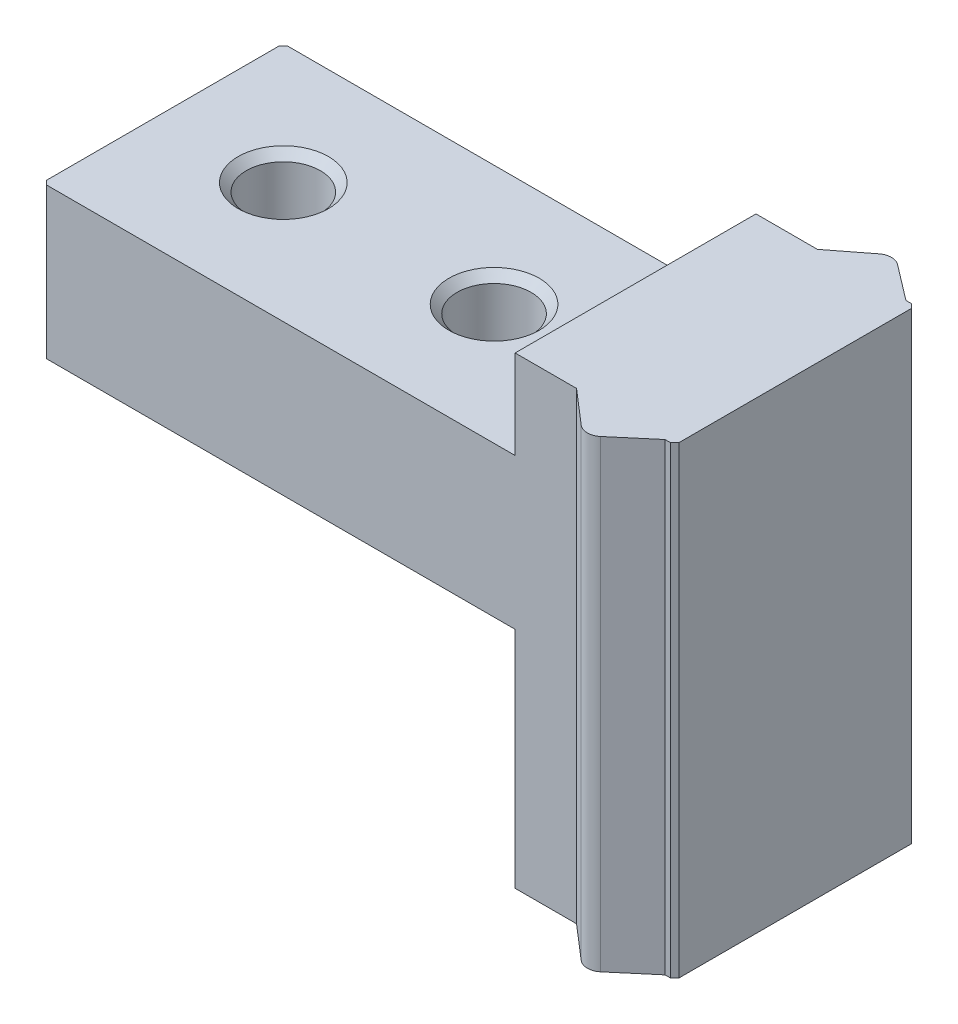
ISO-10303-21;
HEADER;
FILE_DESCRIPTION(('STEP AP214'),'2;1');
FILE_NAME('part.step','',(''),(''),'','','');
FILE_SCHEMA(('AUTOMOTIVE_DESIGN { 1 0 10303 214 1 1 1 1 }'));
ENDSEC;
DATA;
#1=APPLICATION_CONTEXT('core data for automotive mechanical design processes');
#2=APPLICATION_PROTOCOL_DEFINITION('international standard','automotive_design',2000,#1);
#3=PRODUCT_CONTEXT('',#1,'mechanical');
#4=PRODUCT('Part','Part','',(#3));
#5=PRODUCT_RELATED_PRODUCT_CATEGORY('part','',(#4));
#6=PRODUCT_DEFINITION_FORMATION('','',#4);
#7=PRODUCT_DEFINITION_CONTEXT('part definition',#1,'design');
#8=PRODUCT_DEFINITION('design','',#6,#7);
#9=PRODUCT_DEFINITION_SHAPE('','',#8);
#10=(LENGTH_UNIT() NAMED_UNIT(*) SI_UNIT(.MILLI.,.METRE.));
#11=(NAMED_UNIT(*) PLANE_ANGLE_UNIT() SI_UNIT($,.RADIAN.));
#12=(NAMED_UNIT(*) SI_UNIT($,.STERADIAN.) SOLID_ANGLE_UNIT());
#13=UNCERTAINTY_MEASURE_WITH_UNIT(LENGTH_MEASURE(1.E-05),#10,'distance_accuracy_value','');
#14=(GEOMETRIC_REPRESENTATION_CONTEXT(3) GLOBAL_UNCERTAINTY_ASSIGNED_CONTEXT((#13)) GLOBAL_UNIT_ASSIGNED_CONTEXT((#10,
#11,#12)) REPRESENTATION_CONTEXT('',''));
#15=CARTESIAN_POINT('',(0.,0.,0.));
#16=DIRECTION('',(0.,0.,1.));
#17=DIRECTION('',(1.,0.,0.));
#18=AXIS2_PLACEMENT_3D('',#15,#16,#17);
#19=CARTESIAN_POINT('',(-51.8,18.4,-4.));
#20=DIRECTION('',(1.,0.,0.));
#21=DIRECTION('',(0.,0.,-1.));
#22=AXIS2_PLACEMENT_3D('',#19,#20,#21);
#23=PLANE('',#22);
#24=DIRECTION('',(0.,0.,-1.));
#25=VECTOR('',#24,1.);
#26=CARTESIAN_POINT('',(-51.8,15.45,4.));
#27=LINE('',#26,#25);
#28=CARTESIAN_POINT('',(-51.8,15.45,4.));
#29=VERTEX_POINT('',#28);
#30=CARTESIAN_POINT('',(-51.8,15.45,-4.));
#31=VERTEX_POINT('',#30);
#32=EDGE_CURVE('E319',#29,#31,#27,.T.);
#33=ORIENTED_EDGE('',*,*,#32,.F.);
#34=DIRECTION('',(0.,-1.,0.));
#35=VECTOR('',#34,1.);
#36=CARTESIAN_POINT('',(-51.8,18.4,4.));
#37=LINE('',#36,#35);
#38=CARTESIAN_POINT('',(-51.8,18.4,4.));
#39=VERTEX_POINT('',#38);
#40=EDGE_CURVE('E284',#39,#29,#37,.T.);
#41=ORIENTED_EDGE('',*,*,#40,.F.);
#42=DIRECTION('',(0.,0.,1.));
#43=VECTOR('',#42,1.);
#44=CARTESIAN_POINT('',(-51.8,18.4,-4.));
#45=LINE('',#44,#43);
#46=CARTESIAN_POINT('',(-51.8,18.4,-4.));
#47=VERTEX_POINT('',#46);
#48=EDGE_CURVE('E191',#47,#39,#45,.T.);
#49=ORIENTED_EDGE('',*,*,#48,.F.);
#50=DIRECTION('',(0.,-1.,0.));
#51=VECTOR('',#50,1.);
#52=CARTESIAN_POINT('',(-51.8,18.4,-4.));
#53=LINE('',#52,#51);
#54=EDGE_CURVE('E11',#47,#31,#53,.T.);
#55=ORIENTED_EDGE('',*,*,#54,.T.);
#56=EDGE_LOOP('',(#33,#41,#49,#55));
#57=FACE_BOUND('',#56,.T.);
#58=ADVANCED_FACE('F16',(#57),#23,.F.);
#59=CARTESIAN_POINT('',(-49.76,18.4,-4.));
#60=DIRECTION('',(0.,0.,1.));
#61=DIRECTION('',(1.,0.,0.));
#62=AXIS2_PLACEMENT_3D('',#59,#60,#61);
#63=PLANE('',#62);
#64=DIRECTION('',(-1.,0.,0.));
#65=VECTOR('',#64,1.);
#66=CARTESIAN_POINT('',(-49.76,3.,-4.));
#67=LINE('',#66,#65);
#68=CARTESIAN_POINT('',(-49.76,3.,-4.));
#69=VERTEX_POINT('',#68);
#70=CARTESIAN_POINT('',(-51.8,3.,-4.));
#71=VERTEX_POINT('',#70);
#72=EDGE_CURVE('E179',#69,#71,#67,.T.);
#73=ORIENTED_EDGE('',*,*,#72,.T.);
#74=CARTESIAN_POINT('',(-51.8,10.45,-4.));
#75=VERTEX_POINT('',#74);
#76=EDGE_CURVE('E25',#75,#71,#53,.T.);
#77=ORIENTED_EDGE('',*,*,#76,.F.);
#78=DIRECTION('',(-1.,0.,0.));
#79=VECTOR('',#78,1.);
#80=CARTESIAN_POINT('',(-51.8,10.45,-4.));
#81=LINE('',#80,#79);
#82=CARTESIAN_POINT('',(-67.3585786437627,10.45,-4.));
#83=VERTEX_POINT('',#82);
#84=EDGE_CURVE('E341',#75,#83,#81,.T.);
#85=ORIENTED_EDGE('',*,*,#84,.T.);
#86=DIRECTION('',(0.,-1.,0.));
#87=VECTOR('',#86,1.);
#88=CARTESIAN_POINT('',(-67.3585786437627,15.45,-4.));
#89=LINE('',#88,#87);
#90=CARTESIAN_POINT('',(-67.3585786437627,15.45,-4.));
#91=VERTEX_POINT('',#90);
#92=EDGE_CURVE('E184',#91,#83,#89,.T.);
#93=ORIENTED_EDGE('',*,*,#92,.F.);
#94=DIRECTION('',(-1.,0.,0.));
#95=VECTOR('',#94,1.);
#96=CARTESIAN_POINT('',(-51.8,15.45,-4.));
#97=LINE('',#96,#95);
#98=EDGE_CURVE('E321',#31,#91,#97,.T.);
#99=ORIENTED_EDGE('',*,*,#98,.F.);
#100=ORIENTED_EDGE('',*,*,#54,.F.);
#101=DIRECTION('',(-1.,0.,0.));
#102=VECTOR('',#101,1.);
#103=CARTESIAN_POINT('',(-49.76,18.4,-4.));
#104=LINE('',#103,#102);
#105=CARTESIAN_POINT('',(-49.76,18.4,-4.));
#106=VERTEX_POINT('',#105);
#107=EDGE_CURVE('E188',#106,#47,#104,.T.);
#108=ORIENTED_EDGE('',*,*,#107,.F.);
#109=DIRECTION('',(0.,-1.,0.));
#110=VECTOR('',#109,1.);
#111=CARTESIAN_POINT('',(-49.76,18.4,-4.));
#112=LINE('',#111,#110);
#113=EDGE_CURVE('E217',#106,#69,#112,.T.);
#114=ORIENTED_EDGE('',*,*,#113,.T.);
#115=EDGE_LOOP('',(#73,#77,#85,#93,#99,#100,#108,#114));
#116=FACE_BOUND('',#115,.T.);
#117=ADVANCED_FACE('F18',(#116),#63,.F.);
#118=CARTESIAN_POINT('',(-51.8,10.45,4.));
#119=VERTEX_POINT('',#118);
#120=CARTESIAN_POINT('',(-51.8,3.,4.));
#121=VERTEX_POINT('',#120);
#122=EDGE_CURVE('E38',#119,#121,#37,.T.);
#123=ORIENTED_EDGE('',*,*,#122,.F.);
#124=DIRECTION('',(0.,0.,-1.));
#125=VECTOR('',#124,1.);
#126=CARTESIAN_POINT('',(-51.8,10.45,4.));
#127=LINE('',#126,#125);
#128=EDGE_CURVE('E33',#119,#75,#127,.T.);
#129=ORIENTED_EDGE('',*,*,#128,.T.);
#130=ORIENTED_EDGE('',*,*,#76,.T.);
#131=DIRECTION('',(0.,0.,1.));
#132=VECTOR('',#131,1.);
#133=CARTESIAN_POINT('',(-51.8,3.,-4.));
#134=LINE('',#133,#132);
#135=EDGE_CURVE('E182',#71,#121,#134,.T.);
#136=ORIENTED_EDGE('',*,*,#135,.T.);
#137=EDGE_LOOP('',(#123,#129,#130,#136));
#138=FACE_BOUND('',#137,.T.);
#139=ADVANCED_FACE('F296',(#138),#23,.F.);
#140=CARTESIAN_POINT('',(-51.8,18.4,4.));
#141=DIRECTION('',(0.,0.,-1.));
#142=DIRECTION('',(-1.,0.,0.));
#143=AXIS2_PLACEMENT_3D('',#140,#141,#142);
#144=PLANE('',#143);
#145=DIRECTION('',(1.,0.,0.));
#146=VECTOR('',#145,1.);
#147=CARTESIAN_POINT('',(-51.8,3.,4.));
#148=LINE('',#147,#146);
#149=CARTESIAN_POINT('',(-49.76,3.,4.));
#150=VERTEX_POINT('',#149);
#151=EDGE_CURVE('E220',#121,#150,#148,.T.);
#152=ORIENTED_EDGE('',*,*,#151,.T.);
#153=DIRECTION('',(0.,-1.,0.));
#154=VECTOR('',#153,1.);
#155=CARTESIAN_POINT('',(-49.76,18.4,4.));
#156=LINE('',#155,#154);
#157=CARTESIAN_POINT('',(-49.76,18.4,4.));
#158=VERTEX_POINT('',#157);
#159=EDGE_CURVE('E275',#158,#150,#156,.T.);
#160=ORIENTED_EDGE('',*,*,#159,.F.);
#161=DIRECTION('',(1.,0.,0.));
#162=VECTOR('',#161,1.);
#163=CARTESIAN_POINT('',(-51.8,18.4,4.));
#164=LINE('',#163,#162);
#165=EDGE_CURVE('E194',#39,#158,#164,.T.);
#166=ORIENTED_EDGE('',*,*,#165,.F.);
#167=ORIENTED_EDGE('',*,*,#40,.T.);
#168=DIRECTION('',(1.,0.,0.));
#169=VECTOR('',#168,1.);
#170=CARTESIAN_POINT('',(-67.3585786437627,15.45,4.));
#171=LINE('',#170,#169);
#172=CARTESIAN_POINT('',(-67.3585786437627,15.45,4.));
#173=VERTEX_POINT('',#172);
#174=EDGE_CURVE('E164',#173,#29,#171,.T.);
#175=ORIENTED_EDGE('',*,*,#174,.F.);
#176=DIRECTION('',(0.,-1.,0.));
#177=VECTOR('',#176,1.);
#178=CARTESIAN_POINT('',(-67.3585786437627,15.45,4.));
#179=LINE('',#178,#177);
#180=CARTESIAN_POINT('',(-67.3585786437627,10.45,4.));
#181=VERTEX_POINT('',#180);
#182=EDGE_CURVE('E160',#173,#181,#179,.T.);
#183=ORIENTED_EDGE('',*,*,#182,.T.);
#184=DIRECTION('',(1.,0.,0.));
#185=VECTOR('',#184,1.);
#186=CARTESIAN_POINT('',(-67.3585786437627,10.45,4.));
#187=LINE('',#186,#185);
#188=EDGE_CURVE('E294',#181,#119,#187,.T.);
#189=ORIENTED_EDGE('',*,*,#188,.T.);
#190=ORIENTED_EDGE('',*,*,#122,.T.);
#191=EDGE_LOOP('',(#152,#160,#166,#167,#175,#183,#189,#190));
#192=FACE_BOUND('',#191,.T.);
#193=ADVANCED_FACE('F290',(#192),#144,.F.);
#194=CARTESIAN_POINT('',(-49.76,18.4,4.));
#195=DIRECTION('',(0.653523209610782,0.,-0.756906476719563));
#196=DIRECTION('',(-0.756906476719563,0.,-0.653523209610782));
#197=AXIS2_PLACEMENT_3D('',#194,#195,#196);
#198=PLANE('',#197);
#199=DIRECTION('',(0.756906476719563,0.,0.653523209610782));
#200=VECTOR('',#199,1.);
#201=CARTESIAN_POINT('',(-49.76,3.,4.));
#202=LINE('',#201,#200);
#203=CARTESIAN_POINT('',(-48.6267616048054,3.,4.97845323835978));
#204=VERTEX_POINT('',#203);
#205=EDGE_CURVE('E222',#150,#204,#202,.T.);
#206=ORIENTED_EDGE('',*,*,#205,.T.);
#207=DIRECTION('',(0.,-1.,0.));
#208=VECTOR('',#207,1.);
#209=CARTESIAN_POINT('',(-48.6267616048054,18.4,4.97845323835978));
#210=LINE('',#209,#208);
#211=CARTESIAN_POINT('',(-48.6267616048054,18.4,4.97845323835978));
#212=VERTEX_POINT('',#211);
#213=EDGE_CURVE('E272',#212,#204,#210,.T.);
#214=ORIENTED_EDGE('',*,*,#213,.F.);
#215=DIRECTION('',(0.756906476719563,0.,0.653523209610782));
#216=VECTOR('',#215,1.);
#217=CARTESIAN_POINT('',(-49.76,18.4,4.));
#218=LINE('',#217,#216);
#219=EDGE_CURVE('E196',#158,#212,#218,.T.);
#220=ORIENTED_EDGE('',*,*,#219,.F.);
#221=ORIENTED_EDGE('',*,*,#159,.T.);
#222=EDGE_LOOP('',(#206,#214,#220,#221));
#223=FACE_BOUND('',#222,.T.);
#224=ADVANCED_FACE('F305',(#223),#198,.F.);
#225=CARTESIAN_POINT('',(-48.3,18.4,4.6));
#226=DIRECTION('',(0.,-1.,0.));
#227=DIRECTION('',(0.,0.,-1.));
#228=AXIS2_PLACEMENT_3D('',#225,#226,#227);
#229=CYLINDRICAL_SURFACE('',#228,0.500000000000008);
#230=CARTESIAN_POINT('',(-48.3,3.,4.6));
#231=DIRECTION('',(0.,1.,0.));
#232=DIRECTION('',(0.,0.,1.));
#233=AXIS2_PLACEMENT_3D('',#230,#231,#232);
#234=CIRCLE('',#233,0.500000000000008);
#235=CARTESIAN_POINT('',(-47.9765165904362,3.,4.98125907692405));
#236=VERTEX_POINT('',#235);
#237=EDGE_CURVE('E224',#204,#236,#234,.T.);
#238=ORIENTED_EDGE('',*,*,#237,.T.);
#239=DIRECTION('',(0.,-1.,0.));
#240=VECTOR('',#239,1.);
#241=CARTESIAN_POINT('',(-47.9765165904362,18.4,4.98125907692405));
#242=LINE('',#241,#240);
#243=CARTESIAN_POINT('',(-47.9765165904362,18.4,4.98125907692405));
#244=VERTEX_POINT('',#243);
#245=EDGE_CURVE('E269',#244,#236,#242,.T.);
#246=ORIENTED_EDGE('',*,*,#245,.F.);
#247=CARTESIAN_POINT('',(-48.3,18.4,4.6));
#248=DIRECTION('',(0.,1.,0.));
#249=DIRECTION('',(0.,0.,1.));
#250=AXIS2_PLACEMENT_3D('',#247,#248,#249);
#251=CIRCLE('',#250,0.500000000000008);
#252=EDGE_CURVE('E198',#212,#244,#251,.T.);
#253=ORIENTED_EDGE('',*,*,#252,.F.);
#254=ORIENTED_EDGE('',*,*,#213,.T.);
#255=EDGE_LOOP('',(#238,#246,#253,#254));
#256=FACE_BOUND('',#255,.T.);
#257=ADVANCED_FACE('F309',(#256),#229,.T.);
#258=CARTESIAN_POINT('',(-47.9765165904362,18.4,4.98125907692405));
#259=DIRECTION('',(-0.646966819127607,0.,-0.762518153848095));
#260=DIRECTION('',(-0.762518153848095,0.,0.646966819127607));
#261=AXIS2_PLACEMENT_3D('',#258,#259,#260);
#262=PLANE('',#261);
#263=DIRECTION('',(0.762518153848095,0.,-0.646966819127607));
#264=VECTOR('',#263,1.);
#265=CARTESIAN_POINT('',(-47.9765165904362,3.,4.98125907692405));
#266=LINE('',#265,#264);
#267=CARTESIAN_POINT('',(-46.82,3.,4.));
#268=VERTEX_POINT('',#267);
#269=EDGE_CURVE('E226',#236,#268,#266,.T.);
#270=ORIENTED_EDGE('',*,*,#269,.T.);
#271=DIRECTION('',(0.,-1.,0.));
#272=VECTOR('',#271,1.);
#273=CARTESIAN_POINT('',(-46.82,18.4,4.));
#274=LINE('',#273,#272);
#275=CARTESIAN_POINT('',(-46.82,18.4,4.));
#276=VERTEX_POINT('',#275);
#277=EDGE_CURVE('E266',#276,#268,#274,.T.);
#278=ORIENTED_EDGE('',*,*,#277,.F.);
#279=DIRECTION('',(0.762518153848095,0.,-0.646966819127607));
#280=VECTOR('',#279,1.);
#281=CARTESIAN_POINT('',(-47.9765165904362,18.4,4.98125907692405));
#282=LINE('',#281,#280);
#283=EDGE_CURVE('E200',#244,#276,#282,.T.);
#284=ORIENTED_EDGE('',*,*,#283,.F.);
#285=ORIENTED_EDGE('',*,*,#245,.T.);
#286=EDGE_LOOP('',(#270,#278,#284,#285));
#287=FACE_BOUND('',#286,.T.);
#288=ADVANCED_FACE('F407',(#287),#262,.F.);
#289=CARTESIAN_POINT('',(-46.82,18.4,4.));
#290=DIRECTION('',(0.,0.,-1.));
#291=DIRECTION('',(-1.,0.,0.));
#292=AXIS2_PLACEMENT_3D('',#289,#290,#291);
#293=PLANE('',#292);
#294=DIRECTION('',(1.,0.,0.));
#295=VECTOR('',#294,1.);
#296=CARTESIAN_POINT('',(-46.82,3.,4.));
#297=LINE('',#296,#295);
#298=CARTESIAN_POINT('',(-46.6414213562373,3.,4.));
#299=VERTEX_POINT('',#298);
#300=EDGE_CURVE('E228',#268,#299,#297,.T.);
#301=ORIENTED_EDGE('',*,*,#300,.T.);
#302=DIRECTION('',(0.,-1.,0.));
#303=VECTOR('',#302,1.);
#304=CARTESIAN_POINT('',(-46.6414213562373,18.4,4.));
#305=LINE('',#304,#303);
#306=CARTESIAN_POINT('',(-46.6414213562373,18.4,4.));
#307=VERTEX_POINT('',#306);
#308=EDGE_CURVE('E263',#307,#299,#305,.T.);
#309=ORIENTED_EDGE('',*,*,#308,.F.);
#310=DIRECTION('',(1.,0.,0.));
#311=VECTOR('',#310,1.);
#312=CARTESIAN_POINT('',(-46.82,18.4,4.));
#313=LINE('',#312,#311);
#314=EDGE_CURVE('E202',#276,#307,#313,.T.);
#315=ORIENTED_EDGE('',*,*,#314,.F.);
#316=ORIENTED_EDGE('',*,*,#277,.T.);
#317=EDGE_LOOP('',(#301,#309,#315,#316));
#318=FACE_BOUND('',#317,.T.);
#319=ADVANCED_FACE('F410',(#318),#293,.F.);
#320=CARTESIAN_POINT('',(-46.6414213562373,18.4,4.));
#321=DIRECTION('',(-0.707106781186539,0.,-0.707106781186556));
#322=DIRECTION('',(-0.707106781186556,0.,0.707106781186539));
#323=AXIS2_PLACEMENT_3D('',#320,#321,#322);
#324=PLANE('',#323);
#325=DIRECTION('',(0.707106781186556,0.,-0.707106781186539));
#326=VECTOR('',#325,1.);
#327=CARTESIAN_POINT('',(-46.6414213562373,3.,4.));
#328=LINE('',#327,#326);
#329=CARTESIAN_POINT('',(-46.5,3.,3.85857864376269));
#330=VERTEX_POINT('',#329);
#331=EDGE_CURVE('E230',#299,#330,#328,.T.);
#332=ORIENTED_EDGE('',*,*,#331,.T.);
#333=DIRECTION('',(0.,-1.,0.));
#334=VECTOR('',#333,1.);
#335=CARTESIAN_POINT('',(-46.5,18.4,3.85857864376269));
#336=LINE('',#335,#334);
#337=CARTESIAN_POINT('',(-46.5,18.4,3.85857864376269));
#338=VERTEX_POINT('',#337);
#339=EDGE_CURVE('E260',#338,#330,#336,.T.);
#340=ORIENTED_EDGE('',*,*,#339,.F.);
#341=DIRECTION('',(0.707106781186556,0.,-0.707106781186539));
#342=VECTOR('',#341,1.);
#343=CARTESIAN_POINT('',(-46.6414213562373,18.4,4.));
#344=LINE('',#343,#342);
#345=EDGE_CURVE('E204',#307,#338,#344,.T.);
#346=ORIENTED_EDGE('',*,*,#345,.F.);
#347=ORIENTED_EDGE('',*,*,#308,.T.);
#348=EDGE_LOOP('',(#332,#340,#346,#347));
#349=FACE_BOUND('',#348,.T.);
#350=ADVANCED_FACE('F414',(#349),#324,.F.);
#351=CARTESIAN_POINT('',(-46.5,18.4,3.85857864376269));
#352=DIRECTION('',(-1.,0.,0.));
#353=DIRECTION('',(0.,0.,1.));
#354=AXIS2_PLACEMENT_3D('',#351,#352,#353);
#355=PLANE('',#354);
#356=DIRECTION('',(0.,0.,-1.));
#357=VECTOR('',#356,1.);
#358=CARTESIAN_POINT('',(-46.5,3.,3.85857864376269));
#359=LINE('',#358,#357);
#360=CARTESIAN_POINT('',(-46.5,3.,-3.85857864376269));
#361=VERTEX_POINT('',#360);
#362=EDGE_CURVE('E232',#330,#361,#359,.T.);
#363=ORIENTED_EDGE('',*,*,#362,.T.);
#364=DIRECTION('',(0.,-1.,0.));
#365=VECTOR('',#364,1.);
#366=CARTESIAN_POINT('',(-46.5,18.4,-3.85857864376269));
#367=LINE('',#366,#365);
#368=CARTESIAN_POINT('',(-46.5,18.4,-3.85857864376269));
#369=VERTEX_POINT('',#368);
#370=EDGE_CURVE('E257',#369,#361,#367,.T.);
#371=ORIENTED_EDGE('',*,*,#370,.F.);
#372=DIRECTION('',(0.,0.,-1.));
#373=VECTOR('',#372,1.);
#374=CARTESIAN_POINT('',(-46.5,18.4,3.85857864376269));
#375=LINE('',#374,#373);
#376=EDGE_CURVE('E206',#338,#369,#375,.T.);
#377=ORIENTED_EDGE('',*,*,#376,.F.);
#378=ORIENTED_EDGE('',*,*,#339,.T.);
#379=EDGE_LOOP('',(#363,#371,#377,#378));
#380=FACE_BOUND('',#379,.T.);
#381=ADVANCED_FACE('F418',(#380),#355,.F.);
#382=CARTESIAN_POINT('',(-46.5,18.4,-3.85857864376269));
#383=DIRECTION('',(-0.707106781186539,0.,0.707106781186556));
#384=DIRECTION('',(0.707106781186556,0.,0.707106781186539));
#385=AXIS2_PLACEMENT_3D('',#382,#383,#384);
#386=PLANE('',#385);
#387=DIRECTION('',(-0.707106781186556,0.,-0.707106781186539));
#388=VECTOR('',#387,1.);
#389=CARTESIAN_POINT('',(-46.5,3.,-3.85857864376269));
#390=LINE('',#389,#388);
#391=CARTESIAN_POINT('',(-46.6414213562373,3.,-4.));
#392=VERTEX_POINT('',#391);
#393=EDGE_CURVE('E234',#361,#392,#390,.T.);
#394=ORIENTED_EDGE('',*,*,#393,.T.);
#395=DIRECTION('',(0.,-1.,0.));
#396=VECTOR('',#395,1.);
#397=CARTESIAN_POINT('',(-46.6414213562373,18.4,-4.));
#398=LINE('',#397,#396);
#399=CARTESIAN_POINT('',(-46.6414213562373,18.4,-4.));
#400=VERTEX_POINT('',#399);
#401=EDGE_CURVE('E254',#400,#392,#398,.T.);
#402=ORIENTED_EDGE('',*,*,#401,.F.);
#403=DIRECTION('',(-0.707106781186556,0.,-0.707106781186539));
#404=VECTOR('',#403,1.);
#405=CARTESIAN_POINT('',(-46.5,18.4,-3.85857864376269));
#406=LINE('',#405,#404);
#407=EDGE_CURVE('E208',#369,#400,#406,.T.);
#408=ORIENTED_EDGE('',*,*,#407,.F.);
#409=ORIENTED_EDGE('',*,*,#370,.T.);
#410=EDGE_LOOP('',(#394,#402,#408,#409));
#411=FACE_BOUND('',#410,.T.);
#412=ADVANCED_FACE('F422',(#411),#386,.F.);
#413=CARTESIAN_POINT('',(-46.6414213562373,18.4,-4.));
#414=DIRECTION('',(0.,0.,1.));
#415=DIRECTION('',(1.,0.,0.));
#416=AXIS2_PLACEMENT_3D('',#413,#414,#415);
#417=PLANE('',#416);
#418=DIRECTION('',(-1.,0.,0.));
#419=VECTOR('',#418,1.);
#420=CARTESIAN_POINT('',(-46.6414213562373,3.,-4.));
#421=LINE('',#420,#419);
#422=CARTESIAN_POINT('',(-46.82,3.,-4.));
#423=VERTEX_POINT('',#422);
#424=EDGE_CURVE('E236',#392,#423,#421,.T.);
#425=ORIENTED_EDGE('',*,*,#424,.T.);
#426=DIRECTION('',(0.,-1.,0.));
#427=VECTOR('',#426,1.);
#428=CARTESIAN_POINT('',(-46.82,18.4,-4.));
#429=LINE('',#428,#427);
#430=CARTESIAN_POINT('',(-46.82,18.4,-4.));
#431=VERTEX_POINT('',#430);
#432=EDGE_CURVE('E251',#431,#423,#429,.T.);
#433=ORIENTED_EDGE('',*,*,#432,.F.);
#434=DIRECTION('',(-1.,0.,0.));
#435=VECTOR('',#434,1.);
#436=CARTESIAN_POINT('',(-46.6414213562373,18.4,-4.));
#437=LINE('',#436,#435);
#438=EDGE_CURVE('E210',#400,#431,#437,.T.);
#439=ORIENTED_EDGE('',*,*,#438,.F.);
#440=ORIENTED_EDGE('',*,*,#401,.T.);
#441=EDGE_LOOP('',(#425,#433,#439,#440));
#442=FACE_BOUND('',#441,.T.);
#443=ADVANCED_FACE('F426',(#442),#417,.F.);
#444=CARTESIAN_POINT('',(-46.82,18.4,-4.));
#445=DIRECTION('',(-0.606457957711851,0.,0.795115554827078));
#446=DIRECTION('',(0.795115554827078,0.,0.606457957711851));
#447=AXIS2_PLACEMENT_3D('',#444,#445,#446);
#448=PLANE('',#447);
#449=DIRECTION('',(-0.795115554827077,0.,-0.606457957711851));
#450=VECTOR('',#449,1.);
#451=CARTESIAN_POINT('',(-46.82,3.,-4.));
#452=LINE('',#451,#450);
#453=CARTESIAN_POINT('',(-47.9967710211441,3.,-4.89755777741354));
#454=VERTEX_POINT('',#453);
#455=EDGE_CURVE('E238',#423,#454,#452,.T.);
#456=ORIENTED_EDGE('',*,*,#455,.T.);
#457=DIRECTION('',(0.,-1.,0.));
#458=VECTOR('',#457,1.);
#459=CARTESIAN_POINT('',(-47.9967710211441,18.4,-4.89755777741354));
#460=LINE('',#459,#458);
#461=CARTESIAN_POINT('',(-47.9967710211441,18.4,-4.89755777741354));
#462=VERTEX_POINT('',#461);
#463=EDGE_CURVE('E248',#462,#454,#460,.T.);
#464=ORIENTED_EDGE('',*,*,#463,.F.);
#465=DIRECTION('',(-0.795115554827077,0.,-0.606457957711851));
#466=VECTOR('',#465,1.);
#467=CARTESIAN_POINT('',(-46.82,18.4,-4.));
#468=LINE('',#467,#466);
#469=EDGE_CURVE('E212',#431,#462,#468,.T.);
#470=ORIENTED_EDGE('',*,*,#469,.F.);
#471=ORIENTED_EDGE('',*,*,#432,.T.);
#472=EDGE_LOOP('',(#456,#464,#470,#471));
#473=FACE_BOUND('',#472,.T.);
#474=ADVANCED_FACE('F430',(#473),#448,.F.);
#475=CARTESIAN_POINT('',(-48.3,18.4,-4.5));
#476=DIRECTION('',(0.,-1.,0.));
#477=DIRECTION('',(0.,0.,-1.));
#478=AXIS2_PLACEMENT_3D('',#475,#476,#477);
#479=CYLINDRICAL_SURFACE('',#478,0.5);
#480=CARTESIAN_POINT('',(-48.3,3.,-4.5));
#481=DIRECTION('',(0.,1.,0.));
#482=DIRECTION('',(0.,0.,1.));
#483=AXIS2_PLACEMENT_3D('',#480,#481,#482);
#484=CIRCLE('',#483,0.5);
#485=CARTESIAN_POINT('',(-48.6065166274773,3.,-4.89502855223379));
#486=VERTEX_POINT('',#485);
#487=EDGE_CURVE('E240',#454,#486,#484,.T.);
#488=ORIENTED_EDGE('',*,*,#487,.T.);
#489=DIRECTION('',(0.,-1.,0.));
#490=VECTOR('',#489,1.);
#491=CARTESIAN_POINT('',(-48.6065166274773,18.4,-4.89502855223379));
#492=LINE('',#491,#490);
#493=CARTESIAN_POINT('',(-48.6065166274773,18.4,-4.89502855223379));
#494=VERTEX_POINT('',#493);
#495=EDGE_CURVE('E245',#494,#486,#492,.T.);
#496=ORIENTED_EDGE('',*,*,#495,.F.);
#497=CARTESIAN_POINT('',(-48.3,18.4,-4.5));
#498=DIRECTION('',(0.,1.,0.));
#499=DIRECTION('',(0.,0.,1.));
#500=AXIS2_PLACEMENT_3D('',#497,#498,#499);
#501=CIRCLE('',#500,0.5);
#502=EDGE_CURVE('E214',#462,#494,#501,.T.);
#503=ORIENTED_EDGE('',*,*,#502,.F.);
#504=ORIENTED_EDGE('',*,*,#463,.T.);
#505=EDGE_LOOP('',(#488,#496,#503,#504));
#506=FACE_BOUND('',#505,.T.);
#507=ADVANCED_FACE('F434',(#506),#479,.T.);
#508=CARTESIAN_POINT('',(-48.6065166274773,18.4,-4.89502855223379));
#509=DIRECTION('',(0.613033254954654,0.,0.790057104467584));
#510=DIRECTION('',(0.790057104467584,0.,-0.613033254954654));
#511=AXIS2_PLACEMENT_3D('',#508,#509,#510);
#512=PLANE('',#511);
#513=DIRECTION('',(-0.790057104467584,0.,0.613033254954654));
#514=VECTOR('',#513,1.);
#515=CARTESIAN_POINT('',(-48.6065166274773,3.,-4.89502855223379));
#516=LINE('',#515,#514);
#517=EDGE_CURVE('E192',#486,#69,#516,.T.);
#518=ORIENTED_EDGE('',*,*,#517,.T.);
#519=ORIENTED_EDGE('',*,*,#113,.F.);
#520=DIRECTION('',(-0.790057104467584,0.,0.613033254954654));
#521=VECTOR('',#520,1.);
#522=CARTESIAN_POINT('',(-48.6065166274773,18.4,-4.89502855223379));
#523=LINE('',#522,#521);
#524=EDGE_CURVE('E216',#494,#106,#523,.T.);
#525=ORIENTED_EDGE('',*,*,#524,.F.);
#526=ORIENTED_EDGE('',*,*,#495,.T.);
#527=EDGE_LOOP('',(#518,#519,#525,#526));
#528=FACE_BOUND('',#527,.T.);
#529=ADVANCED_FACE('F438',(#528),#512,.F.);
#530=CARTESIAN_POINT('',(-48.3,18.4,4.6));
#531=DIRECTION('',(0.,1.,0.));
#532=DIRECTION('',(0.,0.,1.));
#533=AXIS2_PLACEMENT_3D('',#530,#531,#532);
#534=PLANE('',#533);
#535=ORIENTED_EDGE('',*,*,#107,.T.);
#536=ORIENTED_EDGE('',*,*,#48,.T.);
#537=ORIENTED_EDGE('',*,*,#165,.T.);
#538=ORIENTED_EDGE('',*,*,#219,.T.);
#539=ORIENTED_EDGE('',*,*,#252,.T.);
#540=ORIENTED_EDGE('',*,*,#283,.T.);
#541=ORIENTED_EDGE('',*,*,#314,.T.);
#542=ORIENTED_EDGE('',*,*,#345,.T.);
#543=ORIENTED_EDGE('',*,*,#376,.T.);
#544=ORIENTED_EDGE('',*,*,#407,.T.);
#545=ORIENTED_EDGE('',*,*,#438,.T.);
#546=ORIENTED_EDGE('',*,*,#469,.T.);
#547=ORIENTED_EDGE('',*,*,#502,.T.);
#548=ORIENTED_EDGE('',*,*,#524,.T.);
#549=EDGE_LOOP('',(#535,#536,#537,#538,#539,#540,#541,#542,#543,#544,#545,#546,#547,#548));
#550=FACE_BOUND('',#549,.T.);
#551=ADVANCED_FACE('F313',(#550),#534,.T.);
#552=CARTESIAN_POINT('',(-48.3,3.,4.6));
#553=DIRECTION('',(0.,1.,0.));
#554=DIRECTION('',(0.,0.,1.));
#555=AXIS2_PLACEMENT_3D('',#552,#553,#554);
#556=PLANE('',#555);
#557=ORIENTED_EDGE('',*,*,#72,.F.);
#558=ORIENTED_EDGE('',*,*,#517,.F.);
#559=ORIENTED_EDGE('',*,*,#487,.F.);
#560=ORIENTED_EDGE('',*,*,#455,.F.);
#561=ORIENTED_EDGE('',*,*,#424,.F.);
#562=ORIENTED_EDGE('',*,*,#393,.F.);
#563=ORIENTED_EDGE('',*,*,#362,.F.);
#564=ORIENTED_EDGE('',*,*,#331,.F.);
#565=ORIENTED_EDGE('',*,*,#300,.F.);
#566=ORIENTED_EDGE('',*,*,#269,.F.);
#567=ORIENTED_EDGE('',*,*,#237,.F.);
#568=ORIENTED_EDGE('',*,*,#205,.F.);
#569=ORIENTED_EDGE('',*,*,#151,.F.);
#570=ORIENTED_EDGE('',*,*,#135,.F.);
#571=EDGE_LOOP('',(#557,#558,#559,#560,#561,#562,#563,#564,#565,#566,#567,#568,#569,#570));
#572=FACE_BOUND('',#571,.T.);
#573=ADVANCED_FACE('F300',(#572),#556,.F.);
#574=CARTESIAN_POINT('',(-67.5,15.45,-3.85857864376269));
#575=DIRECTION('',(1.,0.,0.));
#576=DIRECTION('',(0.,0.,-1.));
#577=AXIS2_PLACEMENT_3D('',#574,#575,#576);
#578=PLANE('',#577);
#579=DIRECTION('',(0.,0.,1.));
#580=VECTOR('',#579,1.);
#581=CARTESIAN_POINT('',(-67.5,10.45,-3.85857864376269));
#582=LINE('',#581,#580);
#583=CARTESIAN_POINT('',(-67.5,10.45,-3.85857864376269));
#584=VERTEX_POINT('',#583);
#585=CARTESIAN_POINT('',(-67.5,10.45,3.85857864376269));
#586=VERTEX_POINT('',#585);
#587=EDGE_CURVE('E178',#584,#586,#582,.T.);
#588=ORIENTED_EDGE('',*,*,#587,.T.);
#589=DIRECTION('',(0.,-1.,0.));
#590=VECTOR('',#589,1.);
#591=CARTESIAN_POINT('',(-67.5,15.45,3.85857864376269));
#592=LINE('',#591,#590);
#593=CARTESIAN_POINT('',(-67.5,15.45,3.85857864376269));
#594=VERTEX_POINT('',#593);
#595=EDGE_CURVE('E157',#594,#586,#592,.T.);
#596=ORIENTED_EDGE('',*,*,#595,.F.);
#597=DIRECTION('',(0.,0.,1.));
#598=VECTOR('',#597,1.);
#599=CARTESIAN_POINT('',(-67.5,15.45,-3.85857864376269));
#600=LINE('',#599,#598);
#601=CARTESIAN_POINT('',(-67.5,15.45,-3.85857864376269));
#602=VERTEX_POINT('',#601);
#603=EDGE_CURVE('E165',#602,#594,#600,.T.);
#604=ORIENTED_EDGE('',*,*,#603,.F.);
#605=DIRECTION('',(0.,-1.,0.));
#606=VECTOR('',#605,1.);
#607=CARTESIAN_POINT('',(-67.5,15.45,-3.85857864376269));
#608=LINE('',#607,#606);
#609=EDGE_CURVE('E330',#602,#584,#608,.T.);
#610=ORIENTED_EDGE('',*,*,#609,.T.);
#611=EDGE_LOOP('',(#588,#596,#604,#610));
#612=FACE_BOUND('',#611,.T.);
#613=ADVANCED_FACE('F176',(#612),#578,.F.);
#614=CARTESIAN_POINT('',(-67.5,15.45,3.85857864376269));
#615=DIRECTION('',(0.707106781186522,0.,-0.707106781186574));
#616=DIRECTION('',(-0.707106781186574,0.,-0.707106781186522));
#617=AXIS2_PLACEMENT_3D('',#614,#615,#616);
#618=PLANE('',#617);
#619=DIRECTION('',(0.707106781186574,0.,0.707106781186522));
#620=VECTOR('',#619,1.);
#621=CARTESIAN_POINT('',(-67.5,10.45,3.85857864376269));
#622=LINE('',#621,#620);
#623=EDGE_CURVE('E332',#586,#181,#622,.T.);
#624=ORIENTED_EDGE('',*,*,#623,.T.);
#625=ORIENTED_EDGE('',*,*,#182,.F.);
#626=DIRECTION('',(0.707106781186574,0.,0.707106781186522));
#627=VECTOR('',#626,1.);
#628=CARTESIAN_POINT('',(-67.5,15.45,3.85857864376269));
#629=LINE('',#628,#627);
#630=EDGE_CURVE('E153',#594,#173,#629,.T.);
#631=ORIENTED_EDGE('',*,*,#630,.F.);
#632=ORIENTED_EDGE('',*,*,#595,.T.);
#633=EDGE_LOOP('',(#624,#625,#631,#632));
#634=FACE_BOUND('',#633,.T.);
#635=ADVANCED_FACE('F155',(#634),#618,.F.);
#636=CARTESIAN_POINT('',(-67.3585786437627,15.45,-4.));
#637=DIRECTION('',(0.707106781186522,0.,0.707106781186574));
#638=DIRECTION('',(0.707106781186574,0.,-0.707106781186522));
#639=AXIS2_PLACEMENT_3D('',#636,#637,#638);
#640=PLANE('',#639);
#641=DIRECTION('',(-0.707106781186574,0.,0.707106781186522));
#642=VECTOR('',#641,1.);
#643=CARTESIAN_POINT('',(-67.3585786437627,10.45,-4.));
#644=LINE('',#643,#642);
#645=EDGE_CURVE('E174',#83,#584,#644,.T.);
#646=ORIENTED_EDGE('',*,*,#645,.T.);
#647=ORIENTED_EDGE('',*,*,#609,.F.);
#648=DIRECTION('',(-0.707106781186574,0.,0.707106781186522));
#649=VECTOR('',#648,1.);
#650=CARTESIAN_POINT('',(-67.3585786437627,15.45,-4.));
#651=LINE('',#650,#649);
#652=EDGE_CURVE('E170',#91,#602,#651,.T.);
#653=ORIENTED_EDGE('',*,*,#652,.F.);
#654=ORIENTED_EDGE('',*,*,#92,.T.);
#655=EDGE_LOOP('',(#646,#647,#653,#654));
#656=FACE_BOUND('',#655,.T.);
#657=ADVANCED_FACE('F451',(#656),#640,.F.);
#658=CARTESIAN_POINT('',(0.,15.45,0.));
#659=DIRECTION('',(0.,1.,0.));
#660=DIRECTION('',(0.,0.,1.));
#661=AXIS2_PLACEMENT_3D('',#658,#659,#660);
#662=PLANE('',#661);
#663=CARTESIAN_POINT('',(-56.5,15.45,0.));
#664=DIRECTION('',(0.,-1.,0.));
#665=DIRECTION('',(0.,0.,-1.));
#666=AXIS2_PLACEMENT_3D('',#663,#664,#665);
#667=CIRCLE('',#666,1.5);
#668=CARTESIAN_POINT('',(-56.5,15.45,-1.5));
#669=VERTEX_POINT('',#668);
#670=EDGE_CURVE('E367',#669,#669,#667,.T.);
#671=ORIENTED_EDGE('',*,*,#670,.T.);
#672=EDGE_LOOP('',(#671));
#673=FACE_BOUND('',#672,.T.);
#674=CARTESIAN_POINT('',(-63.5,15.45,0.));
#675=DIRECTION('',(0.,-1.,0.));
#676=DIRECTION('',(0.,0.,-1.));
#677=AXIS2_PLACEMENT_3D('',#674,#675,#676);
#678=CIRCLE('',#677,1.5);
#679=CARTESIAN_POINT('',(-63.5,15.45,-1.5));
#680=VERTEX_POINT('',#679);
#681=EDGE_CURVE('E356',#680,#680,#678,.T.);
#682=ORIENTED_EDGE('',*,*,#681,.T.);
#683=EDGE_LOOP('',(#682));
#684=FACE_BOUND('',#683,.T.);
#685=ORIENTED_EDGE('',*,*,#603,.T.);
#686=ORIENTED_EDGE('',*,*,#630,.T.);
#687=ORIENTED_EDGE('',*,*,#174,.T.);
#688=ORIENTED_EDGE('',*,*,#32,.T.);
#689=ORIENTED_EDGE('',*,*,#98,.T.);
#690=ORIENTED_EDGE('',*,*,#652,.T.);
#691=EDGE_LOOP('',(#685,#686,#687,#688,#689,#690));
#692=FACE_BOUND('',#691,.T.);
#693=ADVANCED_FACE('F168',(#673,#684,#692),#662,.T.);
#694=CARTESIAN_POINT('',(0.,10.45,0.));
#695=DIRECTION('',(0.,1.,0.));
#696=DIRECTION('',(0.,0.,1.));
#697=AXIS2_PLACEMENT_3D('',#694,#695,#696);
#698=PLANE('',#697);
#699=CARTESIAN_POINT('',(-56.5,10.45,0.));
#700=DIRECTION('',(0.,1.,0.));
#701=DIRECTION('',(0.,0.,1.));
#702=AXIS2_PLACEMENT_3D('',#699,#700,#701);
#703=CIRCLE('',#702,1.49);
#704=CARTESIAN_POINT('',(-56.5,10.45,1.49));
#705=VERTEX_POINT('',#704);
#706=EDGE_CURVE('E20',#705,#705,#703,.F.);
#707=ORIENTED_EDGE('',*,*,#706,.F.);
#708=EDGE_LOOP('',(#707));
#709=FACE_BOUND('',#708,.T.);
#710=CARTESIAN_POINT('',(-63.5,10.45,0.));
#711=DIRECTION('',(0.,1.,0.));
#712=DIRECTION('',(0.,0.,1.));
#713=AXIS2_PLACEMENT_3D('',#710,#711,#712);
#714=CIRCLE('',#713,1.49);
#715=CARTESIAN_POINT('',(-63.5,10.45,1.49));
#716=VERTEX_POINT('',#715);
#717=EDGE_CURVE('E333',#716,#716,#714,.F.);
#718=ORIENTED_EDGE('',*,*,#717,.F.);
#719=EDGE_LOOP('',(#718));
#720=FACE_BOUND('',#719,.T.);
#721=ORIENTED_EDGE('',*,*,#587,.F.);
#722=ORIENTED_EDGE('',*,*,#645,.F.);
#723=ORIENTED_EDGE('',*,*,#84,.F.);
#724=ORIENTED_EDGE('',*,*,#128,.F.);
#725=ORIENTED_EDGE('',*,*,#188,.F.);
#726=ORIENTED_EDGE('',*,*,#623,.F.);
#727=EDGE_LOOP('',(#721,#722,#723,#724,#725,#726));
#728=FACE_BOUND('',#727,.T.);
#729=ADVANCED_FACE('F455',(#709,#720,#728),#698,.F.);
#730=CARTESIAN_POINT('',(-63.5,10.7105,0.));
#731=DIRECTION('',(0.,-1.,0.));
#732=DIRECTION('',(0.,0.,-1.));
#733=AXIS2_PLACEMENT_3D('',#730,#731,#732);
#734=CONICAL_SURFACE('',#733,1.2295,0.785398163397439);
#735=CARTESIAN_POINT('',(-63.5,10.7105,0.));
#736=DIRECTION('',(0.,-1.,0.));
#737=DIRECTION('',(0.,0.,-1.));
#738=AXIS2_PLACEMENT_3D('',#735,#736,#737);
#739=CIRCLE('',#738,1.2295);
#740=CARTESIAN_POINT('',(-63.5,10.7105,-1.2295));
#741=VERTEX_POINT('',#740);
#742=EDGE_CURVE('E347',#741,#741,#739,.T.);
#743=ORIENTED_EDGE('',*,*,#742,.F.);
#744=EDGE_LOOP('',(#743));
#745=FACE_BOUND('',#744,.T.);
#746=ORIENTED_EDGE('',*,*,#717,.T.);
#747=EDGE_LOOP('',(#746));
#748=FACE_BOUND('',#747,.T.);
#749=ADVANCED_FACE('F458',(#745,#748),#734,.F.);
#750=CARTESIAN_POINT('',(-63.5,15.45,0.));
#751=DIRECTION('',(0.,-1.,0.));
#752=DIRECTION('',(0.,0.,-1.));
#753=AXIS2_PLACEMENT_3D('',#750,#751,#752);
#754=CYLINDRICAL_SURFACE('',#753,1.2295);
#755=ORIENTED_EDGE('',*,*,#742,.T.);
#756=EDGE_LOOP('',(#755));
#757=FACE_BOUND('',#756,.T.);
#758=CARTESIAN_POINT('',(-63.5,15.1795,0.));
#759=DIRECTION('',(0.,-1.,0.));
#760=DIRECTION('',(0.,0.,-1.));
#761=AXIS2_PLACEMENT_3D('',#758,#759,#760);
#762=CIRCLE('',#761,1.2295);
#763=CARTESIAN_POINT('',(-63.5,15.1795,-1.2295));
#764=VERTEX_POINT('',#763);
#765=EDGE_CURVE('E351',#764,#764,#762,.T.);
#766=ORIENTED_EDGE('',*,*,#765,.F.);
#767=EDGE_LOOP('',(#766));
#768=FACE_BOUND('',#767,.T.);
#769=ADVANCED_FACE('F464',(#757,#768),#754,.F.);
#770=CARTESIAN_POINT('',(-63.5,15.45,0.));
#771=DIRECTION('',(0.,1.,0.));
#772=DIRECTION('',(0.,0.,1.));
#773=AXIS2_PLACEMENT_3D('',#770,#771,#772);
#774=CONICAL_SURFACE('',#773,1.5,0.785398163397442);
#775=ORIENTED_EDGE('',*,*,#765,.T.);
#776=EDGE_LOOP('',(#775));
#777=FACE_BOUND('',#776,.T.);
#778=ORIENTED_EDGE('',*,*,#681,.F.);
#779=EDGE_LOOP('',(#778));
#780=FACE_BOUND('',#779,.T.);
#781=ADVANCED_FACE('F468',(#777,#780),#774,.F.);
#782=CARTESIAN_POINT('',(-56.5,10.7105,0.));
#783=DIRECTION('',(0.,-1.,0.));
#784=DIRECTION('',(0.,0.,-1.));
#785=AXIS2_PLACEMENT_3D('',#782,#783,#784);
#786=CONICAL_SURFACE('',#785,1.2295,0.785398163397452);
#787=CARTESIAN_POINT('',(-56.5,10.7105,0.));
#788=DIRECTION('',(0.,-1.,0.));
#789=DIRECTION('',(0.,0.,-1.));
#790=AXIS2_PLACEMENT_3D('',#787,#788,#789);
#791=CIRCLE('',#790,1.2295);
#792=CARTESIAN_POINT('',(-56.5,10.7105,-1.2295));
#793=VERTEX_POINT('',#792);
#794=EDGE_CURVE('E361',#793,#793,#791,.T.);
#795=ORIENTED_EDGE('',*,*,#794,.F.);
#796=EDGE_LOOP('',(#795));
#797=FACE_BOUND('',#796,.T.);
#798=ORIENTED_EDGE('',*,*,#706,.T.);
#799=EDGE_LOOP('',(#798));
#800=FACE_BOUND('',#799,.T.);
#801=ADVANCED_FACE('F384',(#797,#800),#786,.F.);
#802=CARTESIAN_POINT('',(-56.5,15.45,0.));
#803=DIRECTION('',(0.,-1.,0.));
#804=DIRECTION('',(0.,0.,-1.));
#805=AXIS2_PLACEMENT_3D('',#802,#803,#804);
#806=CYLINDRICAL_SURFACE('',#805,1.2295);
#807=ORIENTED_EDGE('',*,*,#794,.T.);
#808=EDGE_LOOP('',(#807));
#809=FACE_BOUND('',#808,.T.);
#810=CARTESIAN_POINT('',(-56.5,15.1795,0.));
#811=DIRECTION('',(0.,-1.,0.));
#812=DIRECTION('',(0.,0.,-1.));
#813=AXIS2_PLACEMENT_3D('',#810,#811,#812);
#814=CIRCLE('',#813,1.2295);
#815=CARTESIAN_POINT('',(-56.5,15.1795,-1.2295));
#816=VERTEX_POINT('',#815);
#817=EDGE_CURVE('E364',#816,#816,#814,.T.);
#818=ORIENTED_EDGE('',*,*,#817,.F.);
#819=EDGE_LOOP('',(#818));
#820=FACE_BOUND('',#819,.T.);
#821=ADVANCED_FACE('F375',(#809,#820),#806,.F.);
#822=CARTESIAN_POINT('',(-56.5,15.45,0.));
#823=DIRECTION('',(0.,1.,0.));
#824=DIRECTION('',(0.,0.,1.));
#825=AXIS2_PLACEMENT_3D('',#822,#823,#824);
#826=CONICAL_SURFACE('',#825,1.5,0.785398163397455);
#827=ORIENTED_EDGE('',*,*,#817,.T.);
#828=EDGE_LOOP('',(#827));
#829=FACE_BOUND('',#828,.T.);
#830=ORIENTED_EDGE('',*,*,#670,.F.);
#831=EDGE_LOOP('',(#830));
#832=FACE_BOUND('',#831,.T.);
#833=ADVANCED_FACE('F373',(#829,#832),#826,.F.);
#834=CLOSED_SHELL('',(#58,#117,#139,#193,#224,#257,#288,#319,#350,#381,#412,#443,#474,#507,#529,
#551,#573,#613,#635,#657,#693,#729,#749,#769,#781,#801,#821,#833));
#835=MANIFOLD_SOLID_BREP('B1',#834);
#836=ADVANCED_BREP_SHAPE_REPRESENTATION('',(#18,#835),#14);
#837=SHAPE_DEFINITION_REPRESENTATION(#9,#836);
ENDSEC;
END-ISO-10303-21;
